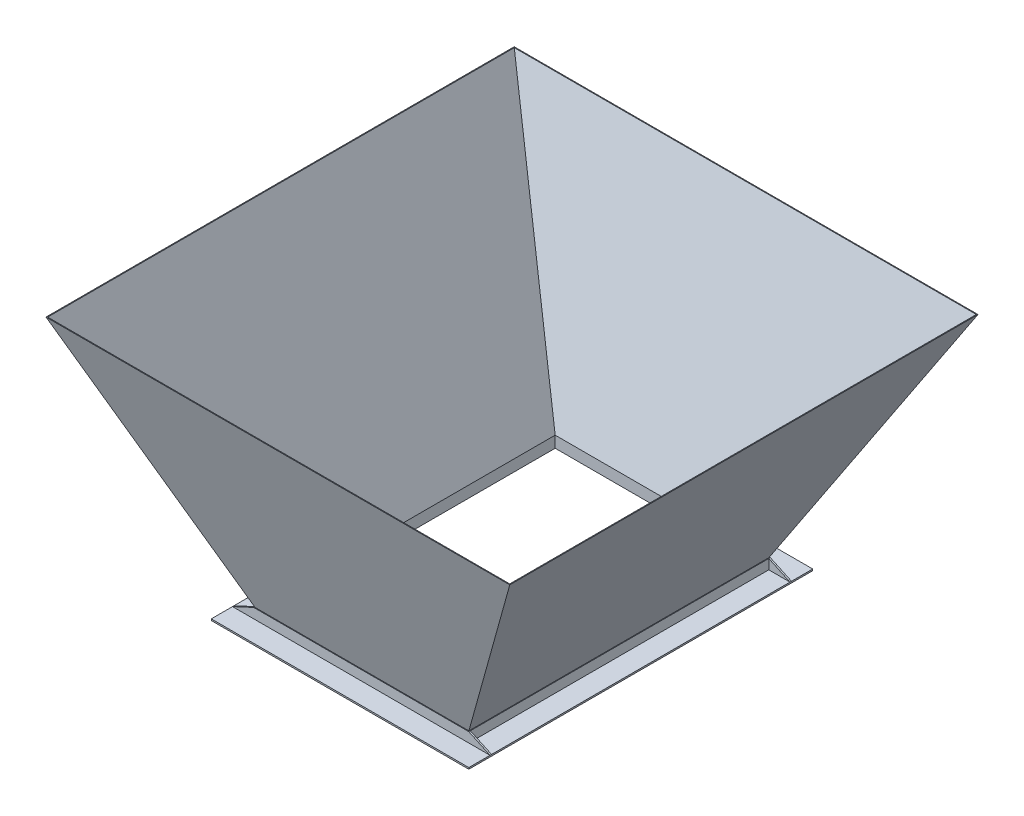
ISO-10303-21;
HEADER;
FILE_DESCRIPTION(('STEP AP214'),'2;1');
FILE_NAME('part.step','',(''),(''),'','','');
FILE_SCHEMA(('AUTOMOTIVE_DESIGN { 1 0 10303 214 1 1 1 1 }'));
ENDSEC;
DATA;
#1=APPLICATION_CONTEXT('core data for automotive mechanical design processes');
#2=APPLICATION_PROTOCOL_DEFINITION('international standard','automotive_design',2000,#1);
#3=PRODUCT_CONTEXT('',#1,'mechanical');
#4=PRODUCT('Part','Part','',(#3));
#5=PRODUCT_RELATED_PRODUCT_CATEGORY('part','',(#4));
#6=PRODUCT_DEFINITION_FORMATION('','',#4);
#7=PRODUCT_DEFINITION_CONTEXT('part definition',#1,'design');
#8=PRODUCT_DEFINITION('design','',#6,#7);
#9=PRODUCT_DEFINITION_SHAPE('','',#8);
#10=(LENGTH_UNIT() NAMED_UNIT(*) SI_UNIT(.MILLI.,.METRE.));
#11=(NAMED_UNIT(*) PLANE_ANGLE_UNIT() SI_UNIT($,.RADIAN.));
#12=(NAMED_UNIT(*) SI_UNIT($,.STERADIAN.) SOLID_ANGLE_UNIT());
#13=UNCERTAINTY_MEASURE_WITH_UNIT(LENGTH_MEASURE(1.E-05),#10,'distance_accuracy_value','');
#14=(GEOMETRIC_REPRESENTATION_CONTEXT(3) GLOBAL_UNCERTAINTY_ASSIGNED_CONTEXT((#13)) GLOBAL_UNIT_ASSIGNED_CONTEXT((#10,
#11,#12)) REPRESENTATION_CONTEXT('',''));
#15=CARTESIAN_POINT('',(0.,0.,0.));
#16=DIRECTION('',(0.,0.,1.));
#17=DIRECTION('',(1.,0.,0.));
#18=AXIS2_PLACEMENT_3D('',#15,#16,#17);
#19=CARTESIAN_POINT('',(-75.4319654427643,10.,2224.43909287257));
#20=DIRECTION('',(0.,1.,0.));
#21=DIRECTION('',(0.,0.,1.));
#22=AXIS2_PLACEMENT_3D('',#19,#20,#21);
#23=PLANE('',#22);
#24=DIRECTION('',(0.,0.,1.));
#25=VECTOR('',#24,1.);
#26=CARTESIAN_POINT('',(64.5680345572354,10.,94.4390928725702));
#27=LINE('',#26,#25);
#28=CARTESIAN_POINT('',(64.5680345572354,10.,104.43909287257));
#29=VERTEX_POINT('',#28);
#30=CARTESIAN_POINT('',(64.5680345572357,10.,2074.43909287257));
#31=VERTEX_POINT('',#30);
#32=EDGE_CURVE('E880',#29,#31,#27,.T.);
#33=ORIENTED_EDGE('',*,*,#32,.F.);
#34=DIRECTION('',(-1.,0.,0.));
#35=VECTOR('',#34,1.);
#36=CARTESIAN_POINT('',(64.5680345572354,10.,104.43909287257));
#37=LINE('',#36,#35);
#38=CARTESIAN_POINT('',(-75.4319654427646,10.,104.43909287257));
#39=VERTEX_POINT('',#38);
#40=EDGE_CURVE('E816',#29,#39,#37,.T.);
#41=ORIENTED_EDGE('',*,*,#40,.T.);
#42=DIRECTION('',(0.,0.,1.));
#43=VECTOR('',#42,1.);
#44=CARTESIAN_POINT('',(-75.4319654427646,10.,-45.5609071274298));
#45=LINE('',#44,#43);
#46=CARTESIAN_POINT('',(-75.4319654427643,10.,2074.43909287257));
#47=VERTEX_POINT('',#46);
#48=EDGE_CURVE('E937',#39,#47,#45,.T.);
#49=ORIENTED_EDGE('',*,*,#48,.T.);
#50=DIRECTION('',(1.,0.,0.));
#51=VECTOR('',#50,1.);
#52=CARTESIAN_POINT('',(-75.4319654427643,10.,2074.43909287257));
#53=LINE('',#52,#51);
#54=EDGE_CURVE('E855',#47,#31,#53,.T.);
#55=ORIENTED_EDGE('',*,*,#54,.T.);
#56=EDGE_LOOP('',(#33,#41,#49,#55));
#57=FACE_BOUND('',#56,.T.);
#58=ADVANCED_FACE('F586',(#57),#23,.T.);
#59=CARTESIAN_POINT('',(64.5680345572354,75.,94.4390928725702));
#60=DIRECTION('',(1.,0.,0.));
#61=DIRECTION('',(0.,0.,-1.));
#62=AXIS2_PLACEMENT_3D('',#59,#60,#61);
#63=PLANE('',#62);
#64=DIRECTION('',(0.,-1.,0.));
#65=VECTOR('',#64,1.);
#66=CARTESIAN_POINT('',(64.5680345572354,75.,104.43909287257));
#67=LINE('',#66,#65);
#68=CARTESIAN_POINT('',(64.5680345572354,75.,104.43909287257));
#69=VERTEX_POINT('',#68);
#70=EDGE_CURVE('E814',#69,#29,#67,.T.);
#71=ORIENTED_EDGE('',*,*,#70,.T.);
#72=ORIENTED_EDGE('',*,*,#32,.T.);
#73=DIRECTION('',(0.,1.,0.));
#74=VECTOR('',#73,1.);
#75=CARTESIAN_POINT('',(64.5680345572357,10.,2074.43909287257));
#76=LINE('',#75,#74);
#77=CARTESIAN_POINT('',(64.5680345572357,75.,2074.43909287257));
#78=VERTEX_POINT('',#77);
#79=EDGE_CURVE('E858',#31,#78,#76,.T.);
#80=ORIENTED_EDGE('',*,*,#79,.T.);
#81=DIRECTION('',(0.,0.,1.));
#82=VECTOR('',#81,1.);
#83=CARTESIAN_POINT('',(64.5680345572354,75.,94.4390928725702));
#84=LINE('',#83,#82);
#85=EDGE_CURVE('E889',#69,#78,#84,.T.);
#86=ORIENTED_EDGE('',*,*,#85,.F.);
#87=EDGE_LOOP('',(#71,#72,#80,#86));
#88=FACE_BOUND('',#87,.T.);
#89=ADVANCED_FACE('F1026',(#88),#63,.F.);
#90=CARTESIAN_POINT('',(-75.4319654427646,10.,-45.5609071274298));
#91=VERTEX_POINT('',#90);
#92=CARTESIAN_POINT('',(-75.4319654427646,10.,94.4390928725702));
#93=VERTEX_POINT('',#92);
#94=EDGE_CURVE('E933',#91,#93,#45,.T.);
#95=ORIENTED_EDGE('',*,*,#94,.T.);
#96=DIRECTION('',(-1.,0.,0.));
#97=VECTOR('',#96,1.);
#98=CARTESIAN_POINT('',(1484.56803455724,10.,94.4390928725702));
#99=LINE('',#98,#97);
#100=CARTESIAN_POINT('',(1624.56803455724,10.,94.4390928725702));
#101=VERTEX_POINT('',#100);
#102=EDGE_CURVE('E887',#101,#93,#99,.T.);
#103=ORIENTED_EDGE('',*,*,#102,.F.);
#104=DIRECTION('',(0.,0.,-1.));
#105=VECTOR('',#104,1.);
#106=CARTESIAN_POINT('',(1624.56803455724,10.,-45.5609071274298));
#107=LINE('',#106,#105);
#108=CARTESIAN_POINT('',(1624.56803455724,10.,-45.5609071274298));
#109=VERTEX_POINT('',#108);
#110=EDGE_CURVE('E939',#101,#109,#107,.T.);
#111=ORIENTED_EDGE('',*,*,#110,.T.);
#112=DIRECTION('',(-1.,0.,0.));
#113=VECTOR('',#112,1.);
#114=CARTESIAN_POINT('',(-75.4319654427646,10.,-45.5609071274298));
#115=LINE('',#114,#113);
#116=EDGE_CURVE('E943',#109,#91,#115,.T.);
#117=ORIENTED_EDGE('',*,*,#116,.T.);
#118=EDGE_LOOP('',(#95,#103,#111,#117));
#119=FACE_BOUND('',#118,.T.);
#120=ADVANCED_FACE('F976',(#119),#23,.T.);
#121=DIRECTION('',(-1.,0.,0.));
#122=VECTOR('',#121,1.);
#123=CARTESIAN_POINT('',(1484.56803455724,10.,104.43909287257));
#124=LINE('',#123,#122);
#125=CARTESIAN_POINT('',(1624.56803455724,10.,104.43909287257));
#126=VERTEX_POINT('',#125);
#127=CARTESIAN_POINT('',(1484.56803455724,10.,104.43909287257));
#128=VERTEX_POINT('',#127);
#129=EDGE_CURVE('E827',#126,#128,#124,.T.);
#130=ORIENTED_EDGE('',*,*,#129,.T.);
#131=DIRECTION('',(0.,0.,-1.));
#132=VECTOR('',#131,1.);
#133=CARTESIAN_POINT('',(1484.56803455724,10.,2084.43909287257));
#134=LINE('',#133,#132);
#135=CARTESIAN_POINT('',(1484.56803455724,10.,2074.43909287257));
#136=VERTEX_POINT('',#135);
#137=EDGE_CURVE('E884',#136,#128,#134,.T.);
#138=ORIENTED_EDGE('',*,*,#137,.F.);
#139=DIRECTION('',(1.,0.,0.));
#140=VECTOR('',#139,1.);
#141=CARTESIAN_POINT('',(1624.56803455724,10.,2074.43909287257));
#142=LINE('',#141,#140);
#143=CARTESIAN_POINT('',(1624.56803455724,10.,2074.43909287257));
#144=VERTEX_POINT('',#143);
#145=EDGE_CURVE('E847',#136,#144,#142,.T.);
#146=ORIENTED_EDGE('',*,*,#145,.T.);
#147=EDGE_CURVE('E944',#144,#126,#107,.T.);
#148=ORIENTED_EDGE('',*,*,#147,.T.);
#149=EDGE_LOOP('',(#130,#138,#146,#148));
#150=FACE_BOUND('',#149,.T.);
#151=ADVANCED_FACE('F990',(#150),#23,.T.);
#152=CARTESIAN_POINT('',(1484.56803455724,75.,2084.43909287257));
#153=DIRECTION('',(-1.,0.,0.));
#154=DIRECTION('',(0.,0.,1.));
#155=AXIS2_PLACEMENT_3D('',#152,#153,#154);
#156=PLANE('',#155);
#157=ORIENTED_EDGE('',*,*,#137,.T.);
#158=DIRECTION('',(0.,1.,0.));
#159=VECTOR('',#158,1.);
#160=CARTESIAN_POINT('',(1484.56803455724,75.,104.43909287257));
#161=LINE('',#160,#159);
#162=CARTESIAN_POINT('',(1484.56803455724,75.,104.43909287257));
#163=VERTEX_POINT('',#162);
#164=EDGE_CURVE('E830',#128,#163,#161,.T.);
#165=ORIENTED_EDGE('',*,*,#164,.T.);
#166=DIRECTION('',(0.,0.,-1.));
#167=VECTOR('',#166,1.);
#168=CARTESIAN_POINT('',(1484.56803455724,75.,2084.43909287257));
#169=LINE('',#168,#167);
#170=CARTESIAN_POINT('',(1484.56803455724,75.,2074.43909287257));
#171=VERTEX_POINT('',#170);
#172=EDGE_CURVE('E895',#171,#163,#169,.T.);
#173=ORIENTED_EDGE('',*,*,#172,.F.);
#174=DIRECTION('',(0.,-1.,0.));
#175=VECTOR('',#174,1.);
#176=CARTESIAN_POINT('',(1484.56803455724,10.,2074.43909287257));
#177=LINE('',#176,#175);
#178=EDGE_CURVE('E845',#171,#136,#177,.T.);
#179=ORIENTED_EDGE('',*,*,#178,.T.);
#180=EDGE_LOOP('',(#157,#165,#173,#179));
#181=FACE_BOUND('',#180,.T.);
#182=ADVANCED_FACE('F1003',(#181),#156,.F.);
#183=CARTESIAN_POINT('',(1624.56803455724,10.,2224.43909287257));
#184=VERTEX_POINT('',#183);
#185=CARTESIAN_POINT('',(1624.56803455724,10.,2084.43909287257));
#186=VERTEX_POINT('',#185);
#187=EDGE_CURVE('E940',#184,#186,#107,.T.);
#188=ORIENTED_EDGE('',*,*,#187,.T.);
#189=DIRECTION('',(1.,0.,0.));
#190=VECTOR('',#189,1.);
#191=CARTESIAN_POINT('',(64.5680345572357,10.,2084.43909287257));
#192=LINE('',#191,#190);
#193=CARTESIAN_POINT('',(-75.4319654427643,10.,2084.43909287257));
#194=VERTEX_POINT('',#193);
#195=EDGE_CURVE('E882',#194,#186,#192,.T.);
#196=ORIENTED_EDGE('',*,*,#195,.F.);
#197=CARTESIAN_POINT('',(-75.4319654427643,10.,2224.43909287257));
#198=VERTEX_POINT('',#197);
#199=EDGE_CURVE('E932',#194,#198,#45,.T.);
#200=ORIENTED_EDGE('',*,*,#199,.T.);
#201=DIRECTION('',(1.,0.,0.));
#202=VECTOR('',#201,1.);
#203=CARTESIAN_POINT('',(-75.4319654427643,10.,2224.43909287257));
#204=LINE('',#203,#202);
#205=EDGE_CURVE('E936',#198,#184,#204,.T.);
#206=ORIENTED_EDGE('',*,*,#205,.T.);
#207=EDGE_LOOP('',(#188,#196,#200,#206));
#208=FACE_BOUND('',#207,.T.);
#209=ADVANCED_FACE('F1012',(#208),#23,.T.);
#210=CARTESIAN_POINT('',(-75.4319654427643,0.,2224.43909287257));
#211=DIRECTION('',(0.,1.,0.));
#212=DIRECTION('',(0.,0.,1.));
#213=AXIS2_PLACEMENT_3D('',#210,#211,#212);
#214=PLANE('',#213);
#215=DIRECTION('',(0.,0.,1.));
#216=VECTOR('',#215,1.);
#217=CARTESIAN_POINT('',(-75.4319654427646,0.,-45.5609071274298));
#218=LINE('',#217,#216);
#219=CARTESIAN_POINT('',(-75.4319654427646,0.,-45.5609071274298));
#220=VERTEX_POINT('',#219);
#221=CARTESIAN_POINT('',(-75.4319654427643,0.,2224.43909287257));
#222=VERTEX_POINT('',#221);
#223=EDGE_CURVE('E923',#220,#222,#218,.T.);
#224=ORIENTED_EDGE('',*,*,#223,.F.);
#225=DIRECTION('',(-1.,0.,0.));
#226=VECTOR('',#225,1.);
#227=CARTESIAN_POINT('',(-75.4319654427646,0.,-45.5609071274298));
#228=LINE('',#227,#226);
#229=CARTESIAN_POINT('',(1624.56803455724,0.,-45.5609071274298));
#230=VERTEX_POINT('',#229);
#231=EDGE_CURVE('E930',#230,#220,#228,.T.);
#232=ORIENTED_EDGE('',*,*,#231,.F.);
#233=DIRECTION('',(0.,0.,-1.));
#234=VECTOR('',#233,1.);
#235=CARTESIAN_POINT('',(1624.56803455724,0.,-45.5609071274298));
#236=LINE('',#235,#234);
#237=CARTESIAN_POINT('',(1624.56803455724,0.,2224.43909287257));
#238=VERTEX_POINT('',#237);
#239=EDGE_CURVE('E928',#238,#230,#236,.T.);
#240=ORIENTED_EDGE('',*,*,#239,.F.);
#241=DIRECTION('',(1.,0.,0.));
#242=VECTOR('',#241,1.);
#243=CARTESIAN_POINT('',(-75.4319654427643,0.,2224.43909287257));
#244=LINE('',#243,#242);
#245=EDGE_CURVE('E926',#222,#238,#244,.T.);
#246=ORIENTED_EDGE('',*,*,#245,.F.);
#247=EDGE_LOOP('',(#224,#232,#240,#246));
#248=FACE_BOUND('',#247,.T.);
#249=DIRECTION('',(0.,0.,1.));
#250=VECTOR('',#249,1.);
#251=CARTESIAN_POINT('',(74.5680345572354,0.,104.43909287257));
#252=LINE('',#251,#250);
#253=CARTESIAN_POINT('',(74.5680345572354,0.,104.43909287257));
#254=VERTEX_POINT('',#253);
#255=CARTESIAN_POINT('',(74.5680345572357,0.,2074.43909287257));
#256=VERTEX_POINT('',#255);
#257=EDGE_CURVE('E901',#254,#256,#252,.T.);
#258=ORIENTED_EDGE('',*,*,#257,.T.);
#259=DIRECTION('',(1.,0.,0.));
#260=VECTOR('',#259,1.);
#261=CARTESIAN_POINT('',(74.5680345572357,0.,2074.43909287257));
#262=LINE('',#261,#260);
#263=CARTESIAN_POINT('',(1474.56803455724,0.,2074.43909287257));
#264=VERTEX_POINT('',#263);
#265=EDGE_CURVE('E904',#256,#264,#262,.T.);
#266=ORIENTED_EDGE('',*,*,#265,.T.);
#267=DIRECTION('',(0.,0.,-1.));
#268=VECTOR('',#267,1.);
#269=CARTESIAN_POINT('',(1474.56803455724,0.,104.43909287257));
#270=LINE('',#269,#268);
#271=CARTESIAN_POINT('',(1474.56803455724,0.,104.43909287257));
#272=VERTEX_POINT('',#271);
#273=EDGE_CURVE('E907',#264,#272,#270,.T.);
#274=ORIENTED_EDGE('',*,*,#273,.T.);
#275=DIRECTION('',(-1.,0.,0.));
#276=VECTOR('',#275,1.);
#277=CARTESIAN_POINT('',(74.5680345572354,0.,104.43909287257));
#278=LINE('',#277,#276);
#279=EDGE_CURVE('E910',#272,#254,#278,.T.);
#280=ORIENTED_EDGE('',*,*,#279,.T.);
#281=EDGE_LOOP('',(#258,#266,#274,#280));
#282=FACE_BOUND('',#281,.T.);
#283=ADVANCED_FACE('F963',(#248,#282),#214,.F.);
#284=CARTESIAN_POINT('',(-75.4319654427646,10.,-45.5609071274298));
#285=DIRECTION('',(1.,0.,0.));
#286=DIRECTION('',(0.,0.,-1.));
#287=AXIS2_PLACEMENT_3D('',#284,#285,#286);
#288=PLANE('',#287);
#289=ORIENTED_EDGE('',*,*,#223,.T.);
#290=DIRECTION('',(0.,-1.,0.));
#291=VECTOR('',#290,1.);
#292=CARTESIAN_POINT('',(-75.4319654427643,10.,2224.43909287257));
#293=LINE('',#292,#291);
#294=EDGE_CURVE('E11',#198,#222,#293,.T.);
#295=ORIENTED_EDGE('',*,*,#294,.F.);
#296=ORIENTED_EDGE('',*,*,#199,.F.);
#297=DIRECTION('',(0.,0.,1.));
#298=VECTOR('',#297,1.);
#299=CARTESIAN_POINT('',(-75.4319654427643,10.,2074.43909287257));
#300=LINE('',#299,#298);
#301=EDGE_CURVE('E865',#47,#194,#300,.T.);
#302=ORIENTED_EDGE('',*,*,#301,.F.);
#303=ORIENTED_EDGE('',*,*,#48,.F.);
#304=DIRECTION('',(0.,0.,-1.));
#305=VECTOR('',#304,1.);
#306=CARTESIAN_POINT('',(-75.4319654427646,10.,104.43909287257));
#307=LINE('',#306,#305);
#308=EDGE_CURVE('E818',#39,#93,#307,.T.);
#309=ORIENTED_EDGE('',*,*,#308,.T.);
#310=ORIENTED_EDGE('',*,*,#94,.F.);
#311=DIRECTION('',(0.,-1.,0.));
#312=VECTOR('',#311,1.);
#313=CARTESIAN_POINT('',(-75.4319654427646,10.,-45.5609071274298));
#314=LINE('',#313,#312);
#315=EDGE_CURVE('E946',#91,#220,#314,.T.);
#316=ORIENTED_EDGE('',*,*,#315,.T.);
#317=EDGE_LOOP('',(#289,#295,#296,#302,#303,#309,#310,#316));
#318=FACE_BOUND('',#317,.T.);
#319=ADVANCED_FACE('F588',(#318),#288,.F.);
#320=CARTESIAN_POINT('',(-75.4319654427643,10.,2224.43909287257));
#321=DIRECTION('',(0.,0.,-1.));
#322=DIRECTION('',(-1.,0.,0.));
#323=AXIS2_PLACEMENT_3D('',#320,#321,#322);
#324=PLANE('',#323);
#325=ORIENTED_EDGE('',*,*,#245,.T.);
#326=DIRECTION('',(0.,-1.,0.));
#327=VECTOR('',#326,1.);
#328=CARTESIAN_POINT('',(1624.56803455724,10.,2224.43909287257));
#329=LINE('',#328,#327);
#330=EDGE_CURVE('E594',#184,#238,#329,.T.);
#331=ORIENTED_EDGE('',*,*,#330,.F.);
#332=ORIENTED_EDGE('',*,*,#205,.F.);
#333=ORIENTED_EDGE('',*,*,#294,.T.);
#334=EDGE_LOOP('',(#325,#331,#332,#333));
#335=FACE_BOUND('',#334,.T.);
#336=ADVANCED_FACE('F1078',(#335),#324,.F.);
#337=CARTESIAN_POINT('',(1624.56803455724,10.,-45.5609071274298));
#338=DIRECTION('',(-1.,0.,0.));
#339=DIRECTION('',(0.,0.,1.));
#340=AXIS2_PLACEMENT_3D('',#337,#338,#339);
#341=PLANE('',#340);
#342=ORIENTED_EDGE('',*,*,#239,.T.);
#343=DIRECTION('',(0.,-1.,0.));
#344=VECTOR('',#343,1.);
#345=CARTESIAN_POINT('',(1624.56803455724,10.,-45.5609071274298));
#346=LINE('',#345,#344);
#347=EDGE_CURVE('E949',#109,#230,#346,.T.);
#348=ORIENTED_EDGE('',*,*,#347,.F.);
#349=ORIENTED_EDGE('',*,*,#110,.F.);
#350=DIRECTION('',(0.,0.,-1.));
#351=VECTOR('',#350,1.);
#352=CARTESIAN_POINT('',(1624.56803455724,10.,104.43909287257));
#353=LINE('',#352,#351);
#354=EDGE_CURVE('E833',#126,#101,#353,.T.);
#355=ORIENTED_EDGE('',*,*,#354,.F.);
#356=ORIENTED_EDGE('',*,*,#147,.F.);
#357=DIRECTION('',(0.,0.,1.));
#358=VECTOR('',#357,1.);
#359=CARTESIAN_POINT('',(1624.56803455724,10.,2074.43909287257));
#360=LINE('',#359,#358);
#361=EDGE_CURVE('E849',#144,#186,#360,.T.);
#362=ORIENTED_EDGE('',*,*,#361,.T.);
#363=ORIENTED_EDGE('',*,*,#187,.F.);
#364=ORIENTED_EDGE('',*,*,#330,.T.);
#365=EDGE_LOOP('',(#342,#348,#349,#355,#356,#362,#363,#364));
#366=FACE_BOUND('',#365,.T.);
#367=ADVANCED_FACE('F956',(#366),#341,.F.);
#368=CARTESIAN_POINT('',(-75.4319654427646,10.,-45.5609071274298));
#369=DIRECTION('',(0.,0.,1.));
#370=DIRECTION('',(1.,0.,0.));
#371=AXIS2_PLACEMENT_3D('',#368,#369,#370);
#372=PLANE('',#371);
#373=ORIENTED_EDGE('',*,*,#231,.T.);
#374=ORIENTED_EDGE('',*,*,#315,.F.);
#375=ORIENTED_EDGE('',*,*,#116,.F.);
#376=ORIENTED_EDGE('',*,*,#347,.T.);
#377=EDGE_LOOP('',(#373,#374,#375,#376));
#378=FACE_BOUND('',#377,.T.);
#379=ADVANCED_FACE('F967',(#378),#372,.F.);
#380=CARTESIAN_POINT('',(74.5680345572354,10.,104.43909287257));
#381=DIRECTION('',(1.,0.,0.));
#382=DIRECTION('',(0.,0.,-1.));
#383=AXIS2_PLACEMENT_3D('',#380,#381,#382);
#384=PLANE('',#383);
#385=ORIENTED_EDGE('',*,*,#257,.F.);
#386=DIRECTION('',(0.,-1.,0.));
#387=VECTOR('',#386,1.);
#388=CARTESIAN_POINT('',(74.5680345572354,10.,104.43909287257));
#389=LINE('',#388,#387);
#390=CARTESIAN_POINT('',(74.5680345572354,75.,104.43909287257));
#391=VERTEX_POINT('',#390);
#392=EDGE_CURVE('E913',#391,#254,#389,.T.);
#393=ORIENTED_EDGE('',*,*,#392,.F.);
#394=DIRECTION('',(0.,0.,1.));
#395=VECTOR('',#394,1.);
#396=CARTESIAN_POINT('',(74.5680345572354,75.,104.43909287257));
#397=LINE('',#396,#395);
#398=CARTESIAN_POINT('',(74.5680345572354,75.,2074.43909287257));
#399=VERTEX_POINT('',#398);
#400=EDGE_CURVE('E765',#391,#399,#397,.T.);
#401=ORIENTED_EDGE('',*,*,#400,.T.);
#402=DIRECTION('',(0.,-1.,0.));
#403=VECTOR('',#402,1.);
#404=CARTESIAN_POINT('',(74.5680345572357,10.,2074.43909287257));
#405=LINE('',#404,#403);
#406=EDGE_CURVE('E920',#399,#256,#405,.T.);
#407=ORIENTED_EDGE('',*,*,#406,.T.);
#408=EDGE_LOOP('',(#385,#393,#401,#407));
#409=FACE_BOUND('',#408,.T.);
#410=ADVANCED_FACE('F1191',(#409),#384,.T.);
#411=CARTESIAN_POINT('',(74.5680345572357,10.,2074.43909287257));
#412=DIRECTION('',(0.,0.,-1.));
#413=DIRECTION('',(-1.,0.,0.));
#414=AXIS2_PLACEMENT_3D('',#411,#412,#413);
#415=PLANE('',#414);
#416=ORIENTED_EDGE('',*,*,#265,.F.);
#417=ORIENTED_EDGE('',*,*,#406,.F.);
#418=DIRECTION('',(1.,0.,0.));
#419=VECTOR('',#418,1.);
#420=CARTESIAN_POINT('',(74.5680345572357,75.,2074.43909287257));
#421=LINE('',#420,#419);
#422=CARTESIAN_POINT('',(1474.56803455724,75.,2074.43909287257));
#423=VERTEX_POINT('',#422);
#424=EDGE_CURVE('E874',#399,#423,#421,.T.);
#425=ORIENTED_EDGE('',*,*,#424,.T.);
#426=DIRECTION('',(0.,-1.,0.));
#427=VECTOR('',#426,1.);
#428=CARTESIAN_POINT('',(1474.56803455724,10.,2074.43909287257));
#429=LINE('',#428,#427);
#430=EDGE_CURVE('E918',#423,#264,#429,.T.);
#431=ORIENTED_EDGE('',*,*,#430,.T.);
#432=EDGE_LOOP('',(#416,#417,#425,#431));
#433=FACE_BOUND('',#432,.T.);
#434=ADVANCED_FACE('F1189',(#433),#415,.T.);
#435=CARTESIAN_POINT('',(1474.56803455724,10.,104.43909287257));
#436=DIRECTION('',(-1.,0.,0.));
#437=DIRECTION('',(0.,0.,1.));
#438=AXIS2_PLACEMENT_3D('',#435,#436,#437);
#439=PLANE('',#438);
#440=ORIENTED_EDGE('',*,*,#273,.F.);
#441=ORIENTED_EDGE('',*,*,#430,.F.);
#442=DIRECTION('',(0.,0.,-1.));
#443=VECTOR('',#442,1.);
#444=CARTESIAN_POINT('',(1474.56803455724,75.,2074.43909287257));
#445=LINE('',#444,#443);
#446=CARTESIAN_POINT('',(1474.56803455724,75.,104.43909287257));
#447=VERTEX_POINT('',#446);
#448=EDGE_CURVE('E877',#423,#447,#445,.T.);
#449=ORIENTED_EDGE('',*,*,#448,.T.);
#450=DIRECTION('',(0.,-1.,0.));
#451=VECTOR('',#450,1.);
#452=CARTESIAN_POINT('',(1474.56803455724,10.,104.43909287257));
#453=LINE('',#452,#451);
#454=EDGE_CURVE('E916',#447,#272,#453,.T.);
#455=ORIENTED_EDGE('',*,*,#454,.T.);
#456=EDGE_LOOP('',(#440,#441,#449,#455));
#457=FACE_BOUND('',#456,.T.);
#458=ADVANCED_FACE('F1186',(#457),#439,.T.);
#459=CARTESIAN_POINT('',(74.5680345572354,10.,104.43909287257));
#460=DIRECTION('',(0.,0.,1.));
#461=DIRECTION('',(1.,0.,0.));
#462=AXIS2_PLACEMENT_3D('',#459,#460,#461);
#463=PLANE('',#462);
#464=ORIENTED_EDGE('',*,*,#279,.F.);
#465=ORIENTED_EDGE('',*,*,#454,.F.);
#466=DIRECTION('',(-1.,0.,0.));
#467=VECTOR('',#466,1.);
#468=CARTESIAN_POINT('',(1474.56803455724,75.,104.43909287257));
#469=LINE('',#468,#467);
#470=EDGE_CURVE('E868',#447,#391,#469,.T.);
#471=ORIENTED_EDGE('',*,*,#470,.T.);
#472=ORIENTED_EDGE('',*,*,#392,.T.);
#473=EDGE_LOOP('',(#464,#465,#471,#472));
#474=FACE_BOUND('',#473,.T.);
#475=ADVANCED_FACE('F1182',(#474),#463,.T.);
#476=CARTESIAN_POINT('',(64.5680345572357,75.,2084.43909287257));
#477=DIRECTION('',(0.,1.,0.));
#478=DIRECTION('',(0.,0.,1.));
#479=AXIS2_PLACEMENT_3D('',#476,#477,#478);
#480=PLANE('',#479);
#481=DIRECTION('',(0.,0.,1.));
#482=VECTOR('',#481,1.);
#483=CARTESIAN_POINT('',(68.8832670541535,75.,2074.43909287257));
#484=LINE('',#483,#482);
#485=CARTESIAN_POINT('',(68.8832670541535,75.,99.11826524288));
#486=VERTEX_POINT('',#485);
#487=CARTESIAN_POINT('',(68.8832670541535,75.,2079.75992050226));
#488=VERTEX_POINT('',#487);
#489=EDGE_CURVE('E601',#486,#488,#484,.T.);
#490=ORIENTED_EDGE('',*,*,#489,.F.);
#491=DIRECTION('',(-1.,0.,0.));
#492=VECTOR('',#491,1.);
#493=CARTESIAN_POINT('',(74.5680345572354,75.,99.11826524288));
#494=LINE('',#493,#492);
#495=CARTESIAN_POINT('',(1480.25280206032,75.,99.1182652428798));
#496=VERTEX_POINT('',#495);
#497=EDGE_CURVE('E606',#496,#486,#494,.T.);
#498=ORIENTED_EDGE('',*,*,#497,.F.);
#499=DIRECTION('',(0.,0.,-1.));
#500=VECTOR('',#499,1.);
#501=CARTESIAN_POINT('',(1480.25280206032,75.,104.43909287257));
#502=LINE('',#501,#500);
#503=CARTESIAN_POINT('',(1480.25280206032,75.,2079.75992050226));
#504=VERTEX_POINT('',#503);
#505=EDGE_CURVE('E804',#504,#496,#502,.T.);
#506=ORIENTED_EDGE('',*,*,#505,.F.);
#507=DIRECTION('',(1.,0.,0.));
#508=VECTOR('',#507,1.);
#509=CARTESIAN_POINT('',(74.5680345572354,75.,2079.75992050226));
#510=LINE('',#509,#508);
#511=EDGE_CURVE('E801',#488,#504,#510,.T.);
#512=ORIENTED_EDGE('',*,*,#511,.F.);
#513=EDGE_LOOP('',(#490,#498,#506,#512));
#514=FACE_BOUND('',#513,.T.);
#515=CARTESIAN_POINT('',(64.5680345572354,75.,94.4390928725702));
#516=VERTEX_POINT('',#515);
#517=EDGE_CURVE('E890',#516,#69,#84,.T.);
#518=ORIENTED_EDGE('',*,*,#517,.T.);
#519=ORIENTED_EDGE('',*,*,#85,.T.);
#520=DIRECTION('',(0.,0.,1.));
#521=VECTOR('',#520,1.);
#522=CARTESIAN_POINT('',(64.5680345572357,75.,2074.43909287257));
#523=LINE('',#522,#521);
#524=CARTESIAN_POINT('',(64.5680345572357,75.,2084.43909287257));
#525=VERTEX_POINT('',#524);
#526=EDGE_CURVE('E864',#78,#525,#523,.T.);
#527=ORIENTED_EDGE('',*,*,#526,.T.);
#528=DIRECTION('',(1.,0.,0.));
#529=VECTOR('',#528,1.);
#530=CARTESIAN_POINT('',(64.5680345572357,75.,2084.43909287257));
#531=LINE('',#530,#529);
#532=CARTESIAN_POINT('',(1484.56803455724,75.,2084.43909287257));
#533=VERTEX_POINT('',#532);
#534=EDGE_CURVE('E893',#525,#533,#531,.T.);
#535=ORIENTED_EDGE('',*,*,#534,.T.);
#536=EDGE_CURVE('E896',#533,#171,#169,.T.);
#537=ORIENTED_EDGE('',*,*,#536,.T.);
#538=ORIENTED_EDGE('',*,*,#172,.T.);
#539=DIRECTION('',(0.,0.,-1.));
#540=VECTOR('',#539,1.);
#541=CARTESIAN_POINT('',(1484.56803455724,75.,104.43909287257));
#542=LINE('',#541,#540);
#543=CARTESIAN_POINT('',(1484.56803455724,75.,94.4390928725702));
#544=VERTEX_POINT('',#543);
#545=EDGE_CURVE('E834',#163,#544,#542,.T.);
#546=ORIENTED_EDGE('',*,*,#545,.T.);
#547=DIRECTION('',(-1.,0.,0.));
#548=VECTOR('',#547,1.);
#549=CARTESIAN_POINT('',(1484.56803455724,75.,94.4390928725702));
#550=LINE('',#549,#548);
#551=EDGE_CURVE('E899',#544,#516,#550,.T.);
#552=ORIENTED_EDGE('',*,*,#551,.T.);
#553=EDGE_LOOP('',(#518,#519,#527,#535,#537,#538,#546,#552));
#554=FACE_BOUND('',#553,.T.);
#555=ADVANCED_FACE('F1006',(#514,#554),#480,.T.);
#556=CARTESIAN_POINT('',(64.5680345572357,75.,2084.43909287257));
#557=DIRECTION('',(0.,0.,-1.));
#558=DIRECTION('',(-1.,0.,0.));
#559=AXIS2_PLACEMENT_3D('',#556,#557,#558);
#560=PLANE('',#559);
#561=ORIENTED_EDGE('',*,*,#195,.T.);
#562=DIRECTION('',(-0.907008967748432,0.421111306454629,0.));
#563=VECTOR('',#562,1.);
#564=CARTESIAN_POINT('',(1484.56803455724,75.,2084.43909287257));
#565=LINE('',#564,#563);
#566=EDGE_CURVE('E837',#186,#533,#565,.T.);
#567=ORIENTED_EDGE('',*,*,#566,.T.);
#568=ORIENTED_EDGE('',*,*,#534,.F.);
#569=DIRECTION('',(-0.907008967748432,-0.421111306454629,0.));
#570=VECTOR('',#569,1.);
#571=CARTESIAN_POINT('',(64.5680345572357,75.,2084.43909287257));
#572=LINE('',#571,#570);
#573=EDGE_CURVE('E852',#525,#194,#572,.T.);
#574=ORIENTED_EDGE('',*,*,#573,.T.);
#575=EDGE_LOOP('',(#561,#567,#568,#574));
#576=FACE_BOUND('',#575,.T.);
#577=ADVANCED_FACE('F1009',(#576),#560,.F.);
#578=CARTESIAN_POINT('',(1484.56803455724,75.,94.4390928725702));
#579=DIRECTION('',(0.,0.,1.));
#580=DIRECTION('',(1.,0.,0.));
#581=AXIS2_PLACEMENT_3D('',#578,#579,#580);
#582=PLANE('',#581);
#583=ORIENTED_EDGE('',*,*,#102,.T.);
#584=DIRECTION('',(0.907008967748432,0.421111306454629,0.));
#585=VECTOR('',#584,1.);
#586=CARTESIAN_POINT('',(-75.4319654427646,10.,94.4390928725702));
#587=LINE('',#586,#585);
#588=EDGE_CURVE('E807',#93,#516,#587,.T.);
#589=ORIENTED_EDGE('',*,*,#588,.T.);
#590=ORIENTED_EDGE('',*,*,#551,.F.);
#591=DIRECTION('',(0.907008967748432,-0.421111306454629,0.));
#592=VECTOR('',#591,1.);
#593=CARTESIAN_POINT('',(1624.56803455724,10.,94.4390928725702));
#594=LINE('',#593,#592);
#595=EDGE_CURVE('E821',#544,#101,#594,.T.);
#596=ORIENTED_EDGE('',*,*,#595,.T.);
#597=EDGE_LOOP('',(#583,#589,#590,#596));
#598=FACE_BOUND('',#597,.T.);
#599=ADVANCED_FACE('F983',(#598),#582,.F.);
#600=CARTESIAN_POINT('',(64.5680345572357,75.,2074.43909287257));
#601=DIRECTION('',(-0.421111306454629,0.907008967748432,0.));
#602=DIRECTION('',(-0.907008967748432,-0.421111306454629,0.));
#603=AXIS2_PLACEMENT_3D('',#600,#601,#602);
#604=PLANE('',#603);
#605=ORIENTED_EDGE('',*,*,#573,.F.);
#606=ORIENTED_EDGE('',*,*,#526,.F.);
#607=DIRECTION('',(-0.907008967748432,-0.421111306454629,0.));
#608=VECTOR('',#607,1.);
#609=CARTESIAN_POINT('',(64.5680345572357,75.,2074.43909287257));
#610=LINE('',#609,#608);
#611=EDGE_CURVE('E861',#78,#47,#610,.T.);
#612=ORIENTED_EDGE('',*,*,#611,.T.);
#613=ORIENTED_EDGE('',*,*,#301,.T.);
#614=EDGE_LOOP('',(#605,#606,#612,#613));
#615=FACE_BOUND('',#614,.T.);
#616=ADVANCED_FACE('F1015',(#615),#604,.T.);
#617=CARTESIAN_POINT('',(64.5680345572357,10.,2074.43909287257));
#618=DIRECTION('',(0.,0.,1.));
#619=DIRECTION('',(1.,0.,0.));
#620=AXIS2_PLACEMENT_3D('',#617,#618,#619);
#621=PLANE('',#620);
#622=ORIENTED_EDGE('',*,*,#54,.F.);
#623=ORIENTED_EDGE('',*,*,#611,.F.);
#624=ORIENTED_EDGE('',*,*,#79,.F.);
#625=EDGE_LOOP('',(#622,#623,#624));
#626=FACE_BOUND('',#625,.T.);
#627=ADVANCED_FACE('F1024',(#626),#621,.F.);
#628=CARTESIAN_POINT('',(1484.56803455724,75.,2074.43909287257));
#629=DIRECTION('',(0.421111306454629,0.907008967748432,0.));
#630=DIRECTION('',(-0.907008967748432,0.421111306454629,0.));
#631=AXIS2_PLACEMENT_3D('',#628,#629,#630);
#632=PLANE('',#631);
#633=ORIENTED_EDGE('',*,*,#566,.F.);
#634=ORIENTED_EDGE('',*,*,#361,.F.);
#635=DIRECTION('',(-0.907008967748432,0.421111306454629,0.));
#636=VECTOR('',#635,1.);
#637=CARTESIAN_POINT('',(1484.56803455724,75.,2074.43909287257));
#638=LINE('',#637,#636);
#639=EDGE_CURVE('E842',#144,#171,#638,.T.);
#640=ORIENTED_EDGE('',*,*,#639,.T.);
#641=ORIENTED_EDGE('',*,*,#536,.F.);
#642=EDGE_LOOP('',(#633,#634,#640,#641));
#643=FACE_BOUND('',#642,.T.);
#644=ADVANCED_FACE('F997',(#643),#632,.T.);
#645=CARTESIAN_POINT('',(1484.56803455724,75.,2074.43909287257));
#646=DIRECTION('',(0.,0.,1.));
#647=DIRECTION('',(1.,0.,0.));
#648=AXIS2_PLACEMENT_3D('',#645,#646,#647);
#649=PLANE('',#648);
#650=ORIENTED_EDGE('',*,*,#639,.F.);
#651=ORIENTED_EDGE('',*,*,#145,.F.);
#652=ORIENTED_EDGE('',*,*,#178,.F.);
#653=EDGE_LOOP('',(#650,#651,#652));
#654=FACE_BOUND('',#653,.T.);
#655=ADVANCED_FACE('F1001',(#654),#649,.F.);
#656=CARTESIAN_POINT('',(1624.56803455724,10.,104.43909287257));
#657=DIRECTION('',(0.421111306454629,0.907008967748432,0.));
#658=DIRECTION('',(-0.907008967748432,0.421111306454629,0.));
#659=AXIS2_PLACEMENT_3D('',#656,#657,#658);
#660=PLANE('',#659);
#661=ORIENTED_EDGE('',*,*,#595,.F.);
#662=ORIENTED_EDGE('',*,*,#545,.F.);
#663=DIRECTION('',(0.907008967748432,-0.421111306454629,0.));
#664=VECTOR('',#663,1.);
#665=CARTESIAN_POINT('',(1624.56803455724,10.,104.43909287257));
#666=LINE('',#665,#664);
#667=EDGE_CURVE('E824',#163,#126,#666,.T.);
#668=ORIENTED_EDGE('',*,*,#667,.T.);
#669=ORIENTED_EDGE('',*,*,#354,.T.);
#670=EDGE_LOOP('',(#661,#662,#668,#669));
#671=FACE_BOUND('',#670,.T.);
#672=ADVANCED_FACE('F1098',(#671),#660,.T.);
#673=CARTESIAN_POINT('',(1484.56803455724,75.,104.43909287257));
#674=DIRECTION('',(0.,0.,1.));
#675=DIRECTION('',(1.,0.,0.));
#676=AXIS2_PLACEMENT_3D('',#673,#674,#675);
#677=PLANE('',#676);
#678=ORIENTED_EDGE('',*,*,#667,.F.);
#679=ORIENTED_EDGE('',*,*,#164,.F.);
#680=ORIENTED_EDGE('',*,*,#129,.F.);
#681=EDGE_LOOP('',(#678,#679,#680));
#682=FACE_BOUND('',#681,.T.);
#683=ADVANCED_FACE('F1041',(#682),#677,.T.);
#684=CARTESIAN_POINT('',(-75.4319654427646,10.,104.43909287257));
#685=DIRECTION('',(-0.421111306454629,0.907008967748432,0.));
#686=DIRECTION('',(-0.907008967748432,-0.421111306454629,0.));
#687=AXIS2_PLACEMENT_3D('',#684,#685,#686);
#688=PLANE('',#687);
#689=ORIENTED_EDGE('',*,*,#588,.F.);
#690=ORIENTED_EDGE('',*,*,#308,.F.);
#691=DIRECTION('',(0.907008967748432,0.421111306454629,0.));
#692=VECTOR('',#691,1.);
#693=CARTESIAN_POINT('',(-75.4319654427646,10.,104.43909287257));
#694=LINE('',#693,#692);
#695=EDGE_CURVE('E811',#39,#69,#694,.T.);
#696=ORIENTED_EDGE('',*,*,#695,.T.);
#697=ORIENTED_EDGE('',*,*,#517,.F.);
#698=EDGE_LOOP('',(#689,#690,#696,#697));
#699=FACE_BOUND('',#698,.T.);
#700=ADVANCED_FACE('F979',(#699),#688,.T.);
#701=CARTESIAN_POINT('',(64.5680345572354,75.,104.43909287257));
#702=DIRECTION('',(0.,0.,-1.));
#703=DIRECTION('',(-1.,0.,0.));
#704=AXIS2_PLACEMENT_3D('',#701,#702,#703);
#705=PLANE('',#704);
#706=ORIENTED_EDGE('',*,*,#695,.F.);
#707=ORIENTED_EDGE('',*,*,#40,.F.);
#708=ORIENTED_EDGE('',*,*,#70,.F.);
#709=EDGE_LOOP('',(#706,#707,#708));
#710=FACE_BOUND('',#709,.T.);
#711=ADVANCED_FACE('F1029',(#710),#705,.F.);
#712=CARTESIAN_POINT('',(-750.431965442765,1600.,2629.43909287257));
#713=DIRECTION('',(0.,1.,0.));
#714=DIRECTION('',(0.,0.,1.));
#715=AXIS2_PLACEMENT_3D('',#712,#713,#714);
#716=PLANE('',#715);
#717=DIRECTION('',(0.,0.,-1.));
#718=VECTOR('',#717,1.);
#719=CARTESIAN_POINT('',(-756.116732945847,1600.,2629.43909287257));
#720=LINE('',#719,#718);
#721=CARTESIAN_POINT('',(-756.116732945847,1600.,2634.75992050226));
#722=VERTEX_POINT('',#721);
#723=CARTESIAN_POINT('',(-756.116732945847,1600.,-455.88173475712));
#724=VERTEX_POINT('',#723);
#725=EDGE_CURVE('E779',#722,#724,#720,.T.);
#726=ORIENTED_EDGE('',*,*,#725,.F.);
#727=DIRECTION('',(-1.,0.,0.));
#728=VECTOR('',#727,1.);
#729=CARTESIAN_POINT('',(2299.56803455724,1600.,2634.75992050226));
#730=LINE('',#729,#728);
#731=CARTESIAN_POINT('',(2305.25280206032,1600.,2634.75992050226));
#732=VERTEX_POINT('',#731);
#733=EDGE_CURVE('E793',#732,#722,#730,.T.);
#734=ORIENTED_EDGE('',*,*,#733,.F.);
#735=DIRECTION('',(0.,0.,1.));
#736=VECTOR('',#735,1.);
#737=CARTESIAN_POINT('',(2305.25280206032,1600.,2629.43909287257));
#738=LINE('',#737,#736);
#739=CARTESIAN_POINT('',(2305.25280206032,1600.,-455.881734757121));
#740=VERTEX_POINT('',#739);
#741=EDGE_CURVE('E795',#740,#732,#738,.T.);
#742=ORIENTED_EDGE('',*,*,#741,.F.);
#743=DIRECTION('',(1.,0.,0.));
#744=VECTOR('',#743,1.);
#745=CARTESIAN_POINT('',(-750.431965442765,1600.,-455.88173475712));
#746=LINE('',#745,#744);
#747=EDGE_CURVE('E791',#724,#740,#746,.T.);
#748=ORIENTED_EDGE('',*,*,#747,.F.);
#749=EDGE_LOOP('',(#726,#734,#742,#748));
#750=FACE_BOUND('',#749,.T.);
#751=DIRECTION('',(-1.,0.,0.));
#752=VECTOR('',#751,1.);
#753=CARTESIAN_POINT('',(-750.431965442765,1600.,2629.43909287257));
#754=LINE('',#753,#752);
#755=CARTESIAN_POINT('',(2299.56803455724,1600.,2629.43909287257));
#756=VERTEX_POINT('',#755);
#757=CARTESIAN_POINT('',(-750.431965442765,1600.,2629.43909287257));
#758=VERTEX_POINT('',#757);
#759=EDGE_CURVE('E770',#756,#758,#754,.T.);
#760=ORIENTED_EDGE('',*,*,#759,.T.);
#761=DIRECTION('',(0.,0.,-1.));
#762=VECTOR('',#761,1.);
#763=CARTESIAN_POINT('',(-750.431965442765,1600.,-450.56090712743));
#764=LINE('',#763,#762);
#765=CARTESIAN_POINT('',(-750.431965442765,1600.,-450.56090712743));
#766=VERTEX_POINT('',#765);
#767=EDGE_CURVE('E762',#758,#766,#764,.T.);
#768=ORIENTED_EDGE('',*,*,#767,.T.);
#769=DIRECTION('',(1.,0.,0.));
#770=VECTOR('',#769,1.);
#771=CARTESIAN_POINT('',(-750.431965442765,1600.,-450.56090712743));
#772=LINE('',#771,#770);
#773=CARTESIAN_POINT('',(2299.56803455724,1600.,-450.56090712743));
#774=VERTEX_POINT('',#773);
#775=EDGE_CURVE('E746',#766,#774,#772,.T.);
#776=ORIENTED_EDGE('',*,*,#775,.T.);
#777=DIRECTION('',(0.,0.,1.));
#778=VECTOR('',#777,1.);
#779=CARTESIAN_POINT('',(2299.56803455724,1600.,-450.56090712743));
#780=LINE('',#779,#778);
#781=EDGE_CURVE('E756',#774,#756,#780,.T.);
#782=ORIENTED_EDGE('',*,*,#781,.T.);
#783=EDGE_LOOP('',(#760,#768,#776,#782));
#784=FACE_BOUND('',#783,.T.);
#785=ADVANCED_FACE('F768',(#750,#784),#716,.T.);
#786=CARTESIAN_POINT('',(2299.56803455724,1598.29004784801,2634.13761004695));
#787=DIRECTION('',(0.,-0.341990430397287,0.939703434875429));
#788=DIRECTION('',(0.,-0.939703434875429,-0.341990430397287));
#789=AXIS2_PLACEMENT_3D('',#786,#787,#788);
#790=PLANE('',#789);
#791=DIRECTION('',(0.453168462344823,0.837675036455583,0.304858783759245));
#792=VECTOR('',#791,1.);
#793=CARTESIAN_POINT('',(1206.1900828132,-431.600784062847,1895.39045482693));
#794=LINE('',#793,#792);
#795=EDGE_CURVE('E781',#504,#732,#794,.T.);
#796=ORIENTED_EDGE('',*,*,#795,.T.);
#797=ORIENTED_EDGE('',*,*,#733,.T.);
#798=DIRECTION('',(-0.453168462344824,0.837675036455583,0.304858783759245));
#799=VECTOR('',#798,1.);
#800=CARTESIAN_POINT('',(-754.214214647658,1596.48322375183,2633.48004455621));
#801=LINE('',#800,#799);
#802=EDGE_CURVE('E784',#488,#722,#801,.T.);
#803=ORIENTED_EDGE('',*,*,#802,.F.);
#804=ORIENTED_EDGE('',*,*,#511,.T.);
#805=EDGE_LOOP('',(#796,#797,#803,#804));
#806=FACE_BOUND('',#805,.T.);
#807=ADVANCED_FACE('F1037',(#806),#790,.T.);
#808=CARTESIAN_POINT('',(-754.829682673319,1597.620907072,2629.43909287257));
#809=DIRECTION('',(-0.87954344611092,-0.47581858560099,0.));
#810=DIRECTION('',(0.47581858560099,-0.87954344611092,0.));
#811=AXIS2_PLACEMENT_3D('',#808,#809,#810);
#812=PLANE('',#811);
#813=ORIENTED_EDGE('',*,*,#802,.T.);
#814=ORIENTED_EDGE('',*,*,#725,.T.);
#815=DIRECTION('',(-0.453168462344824,0.837675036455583,-0.304858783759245));
#816=VECTOR('',#815,1.);
#817=CARTESIAN_POINT('',(-328.704864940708,809.935637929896,-168.350114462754));
#818=LINE('',#817,#816);
#819=EDGE_CURVE('E788',#486,#724,#818,.T.);
#820=ORIENTED_EDGE('',*,*,#819,.F.);
#821=ORIENTED_EDGE('',*,*,#489,.T.);
#822=EDGE_LOOP('',(#813,#814,#820,#821));
#823=FACE_BOUND('',#822,.T.);
#824=ADVANCED_FACE('F1126',(#823),#812,.T.);
#825=CARTESIAN_POINT('',(1478.96575178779,72.620907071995,104.43909287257));
#826=DIRECTION('',(-0.879543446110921,0.475818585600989,0.));
#827=DIRECTION('',(-0.47581858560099,-0.879543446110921,0.));
#828=AXIS2_PLACEMENT_3D('',#825,#826,#827);
#829=PLANE('',#828);
#830=DIRECTION('',(0.453168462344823,0.837675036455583,-0.304858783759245));
#831=VECTOR('',#830,1.);
#832=CARTESIAN_POINT('',(1478.35028376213,71.4832237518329,100.398141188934));
#833=LINE('',#832,#831);
#834=EDGE_CURVE('E785',#496,#740,#833,.T.);
#835=ORIENTED_EDGE('',*,*,#834,.T.);
#836=ORIENTED_EDGE('',*,*,#741,.T.);
#837=ORIENTED_EDGE('',*,*,#795,.F.);
#838=ORIENTED_EDGE('',*,*,#505,.T.);
#839=EDGE_LOOP('',(#835,#836,#837,#838));
#840=FACE_BOUND('',#839,.T.);
#841=ADVANCED_FACE('F1134',(#840),#829,.F.);
#842=CARTESIAN_POINT('',(74.5680345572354,73.2900478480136,99.7405756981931));
#843=DIRECTION('',(0.,0.341990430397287,0.939703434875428));
#844=DIRECTION('',(0.,-0.939703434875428,0.341990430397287));
#845=AXIS2_PLACEMENT_3D('',#842,#843,#844);
#846=PLANE('',#845);
#847=ORIENTED_EDGE('',*,*,#819,.T.);
#848=ORIENTED_EDGE('',*,*,#747,.T.);
#849=ORIENTED_EDGE('',*,*,#834,.F.);
#850=ORIENTED_EDGE('',*,*,#497,.T.);
#851=EDGE_LOOP('',(#847,#848,#849,#850));
#852=FACE_BOUND('',#851,.T.);
#853=ADVANCED_FACE('F1040',(#852),#846,.F.);
#854=CARTESIAN_POINT('',(2299.56803455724,1600.,2629.43909287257));
#855=DIRECTION('',(0.,-0.341990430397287,0.939703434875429));
#856=DIRECTION('',(0.,-0.939703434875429,-0.341990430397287));
#857=AXIS2_PLACEMENT_3D('',#854,#855,#856);
#858=PLANE('',#857);
#859=DIRECTION('',(0.453168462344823,0.837675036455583,0.304858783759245));
#860=VECTOR('',#859,1.);
#861=CARTESIAN_POINT('',(1474.56803455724,75.,2074.43909287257));
#862=LINE('',#861,#860);
#863=EDGE_CURVE('E776',#423,#756,#862,.T.);
#864=ORIENTED_EDGE('',*,*,#863,.F.);
#865=ORIENTED_EDGE('',*,*,#424,.F.);
#866=DIRECTION('',(-0.453168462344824,0.837675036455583,0.304858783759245));
#867=VECTOR('',#866,1.);
#868=CARTESIAN_POINT('',(74.5680345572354,75.,2074.43909287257));
#869=LINE('',#868,#867);
#870=EDGE_CURVE('E777',#399,#758,#869,.T.);
#871=ORIENTED_EDGE('',*,*,#870,.T.);
#872=ORIENTED_EDGE('',*,*,#759,.F.);
#873=EDGE_LOOP('',(#864,#865,#871,#872));
#874=FACE_BOUND('',#873,.T.);
#875=ADVANCED_FACE('F1149',(#874),#858,.F.);
#876=CARTESIAN_POINT('',(-750.431965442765,1600.,2629.43909287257));
#877=DIRECTION('',(-0.87954344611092,-0.47581858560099,0.));
#878=DIRECTION('',(0.47581858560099,-0.87954344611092,0.));
#879=AXIS2_PLACEMENT_3D('',#876,#877,#878);
#880=PLANE('',#879);
#881=ORIENTED_EDGE('',*,*,#870,.F.);
#882=ORIENTED_EDGE('',*,*,#400,.F.);
#883=DIRECTION('',(-0.453168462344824,0.837675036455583,-0.304858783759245));
#884=VECTOR('',#883,1.);
#885=CARTESIAN_POINT('',(74.5680345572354,75.,104.43909287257));
#886=LINE('',#885,#884);
#887=EDGE_CURVE('E749',#391,#766,#886,.T.);
#888=ORIENTED_EDGE('',*,*,#887,.T.);
#889=ORIENTED_EDGE('',*,*,#767,.F.);
#890=EDGE_LOOP('',(#881,#882,#888,#889));
#891=FACE_BOUND('',#890,.T.);
#892=ADVANCED_FACE('F761',(#891),#880,.F.);
#893=CARTESIAN_POINT('',(1474.56803455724,75.,104.43909287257));
#894=DIRECTION('',(-0.879543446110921,0.475818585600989,0.));
#895=DIRECTION('',(-0.47581858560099,-0.879543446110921,0.));
#896=AXIS2_PLACEMENT_3D('',#893,#894,#895);
#897=PLANE('',#896);
#898=DIRECTION('',(0.453168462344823,0.837675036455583,-0.304858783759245));
#899=VECTOR('',#898,1.);
#900=CARTESIAN_POINT('',(1474.56803455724,75.,104.43909287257));
#901=LINE('',#900,#899);
#902=EDGE_CURVE('E752',#447,#774,#901,.T.);
#903=ORIENTED_EDGE('',*,*,#902,.F.);
#904=ORIENTED_EDGE('',*,*,#448,.F.);
#905=ORIENTED_EDGE('',*,*,#863,.T.);
#906=ORIENTED_EDGE('',*,*,#781,.F.);
#907=EDGE_LOOP('',(#903,#904,#905,#906));
#908=FACE_BOUND('',#907,.T.);
#909=ADVANCED_FACE('F1163',(#908),#897,.T.);
#910=CARTESIAN_POINT('',(74.5680345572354,75.,104.43909287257));
#911=DIRECTION('',(0.,0.341990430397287,0.939703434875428));
#912=DIRECTION('',(0.,-0.939703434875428,0.341990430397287));
#913=AXIS2_PLACEMENT_3D('',#910,#911,#912);
#914=PLANE('',#913);
#915=ORIENTED_EDGE('',*,*,#887,.F.);
#916=ORIENTED_EDGE('',*,*,#470,.F.);
#917=ORIENTED_EDGE('',*,*,#902,.T.);
#918=ORIENTED_EDGE('',*,*,#775,.F.);
#919=EDGE_LOOP('',(#915,#916,#917,#918));
#920=FACE_BOUND('',#919,.T.);
#921=ADVANCED_FACE('F748',(#920),#914,.T.);
#922=CLOSED_SHELL('',(#58,#89,#120,#151,#182,#209,#283,#319,#336,#367,#379,#410,#434,#458,#475,
#555,#577,#599,#616,#627,#644,#655,#672,#683,#700,#711,#785,#807,#824,#841,#853,#875,#892,#909,#921));
#923=MANIFOLD_SOLID_BREP('B2',#922);
#924=ADVANCED_BREP_SHAPE_REPRESENTATION('',(#18,#923),#14);
#925=SHAPE_DEFINITION_REPRESENTATION(#9,#924);
ENDSEC;
END-ISO-10303-21;
